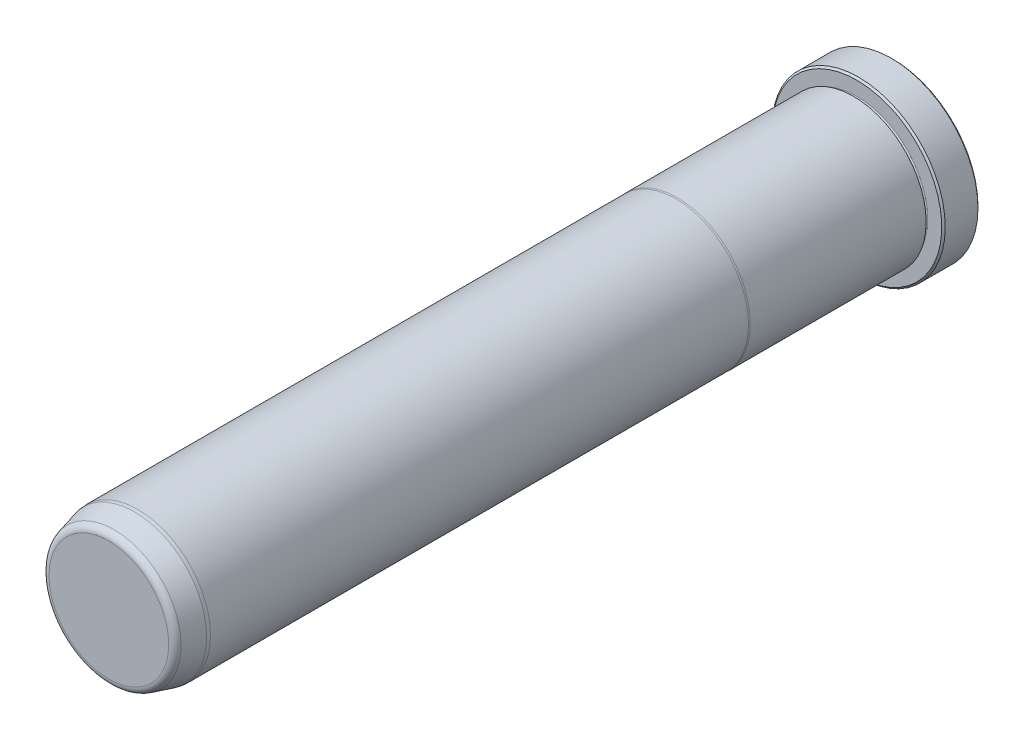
from build123d import *

# Parameters (mm, degrees)
FILLET6_R     = 1.5875
CHAMFER1_SIZE = 0.381


with BuildPart() as part:
    # Sketch1 → Revolve1 (revolve)
    with BuildSketch(Plane(origin=(0, 0, 0), x_dir=(0, 0, -1), z_dir=(1, 0, 0)), mode=Mode.PRIVATE) as revolve1_sk:
        with BuildLine():
            Line((0, 0), (0, 18.923))
            Line((0, 18.923), (-7.9248, 18.923))
            Line((-7.9248, 18.923), (-7.9248, 15.4813))
            ThreePointArc((-7.9248, 15.4813), (-8.3058, 15.1003), (-8.6868, 15.4813))
            Line((-8.6868, 15.4813), (-8.6868, 15.8877))
            Line((-8.6868, 15.8877), (-47.134763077, 15.8877))
            Line((-47.134763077, 15.8877), (-47.498, 15.8623))
            Line((-47.498, 15.8623), (-165.1, 15.8623))
            Line((-165.1, 15.8623), (-165.862, 15.795633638))
            Line((-165.862, 15.795633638), (-171.45, 14.298333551))
            Line((-171.45, 14.298333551), (-171.45, 0))
            Line((-171.45, 0), (0, 0))
        make_face()
    revolve(revolve1_sk.sketch.rotate(Axis((0, 0, 0), (0, 0, -1)), 90), axis=Axis((0, 0, 0), (0, 0, -1)))

    # Fillet6
    fillet6_edges = [part.edges().sort_by_distance(p)[0] for p in [
        (-14.298333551, 0, 171.45),
    ]]
    fillet(fillet6_edges, radius=FILLET6_R)

    # Chamfer1
    chamfer1_edges = [part.edges().sort_by_distance(p)[0] for p in [
        (-18.923, 0, 7.9248),
        (-18.923, 0, 0),
    ]]
    chamfer(chamfer1_edges, length=CHAMFER1_SIZE)


solid = part.part
